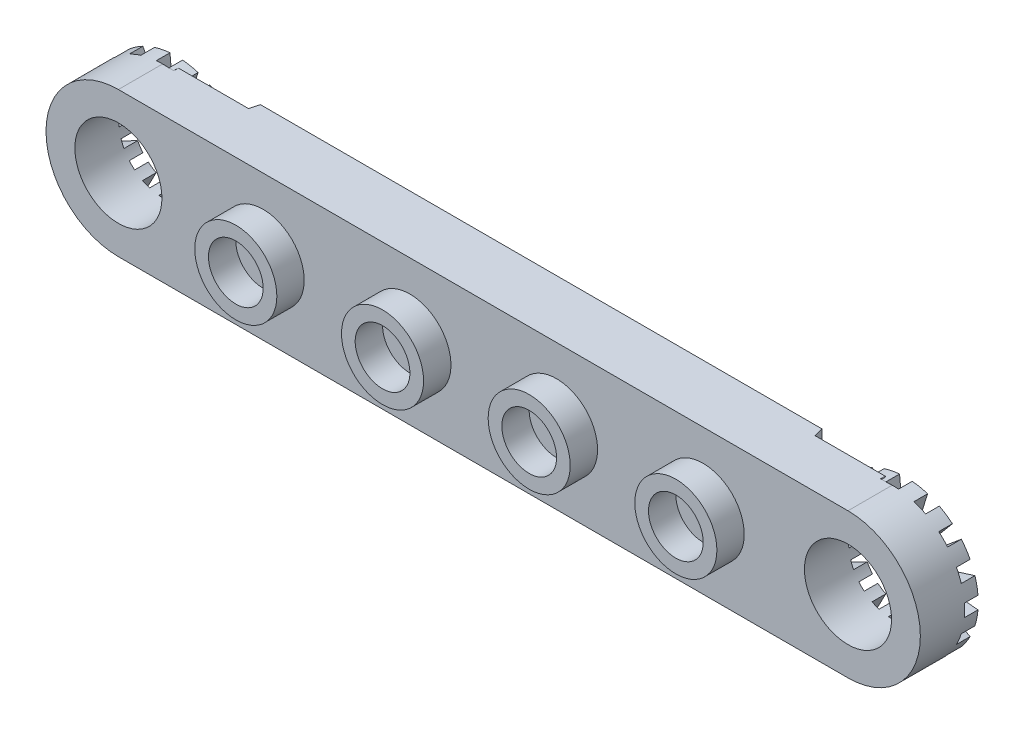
from build123d import *
from OCP.BRepFilletAPI import BRepFilletAPI_MakeChamfer

# Parameters (mm, degrees)
SKETCH1_R             = 2.3876
EXTRUDE1_DEPTH        = 1.2065
SKETCH2_R             = 2.25
SKETCH2_R_2           = 1.5
EXTRUDE_THIN1_DEPTH   = 1.5
SKETCH3_W             = 30.7924
SKETCH3_H             = 7.9375
EXTRUDE2_DEPTH        = 0.762
CHAMFER1_SIZE         = 0.2
CHAMFER1_SIZE2        = 0.76
CUT_EXTRUDE1_START    = -1.5
SKETCH4_W             = 5.5
SKETCH4_H             = 4.9375
CUT_EXTRUDE1_DEPTH    = 1.5
EXTRUDE3_DEPTH        = 0.25
SKETCH7_R             = 3.96875
SKETCH7_R_2           = 2.3876
EXTRUDE4_DEPTH        = 0.762
CUT_EXTRUDE3_START    = -0.75
CUT_EXTRUDE3_DEPTH    = 0.75
CIRPATTERN1_COUNT     = 16
MIRROR2_START         = -0.75
MIRROR2_COPY_1_DEPTH  = 0.75
MIRROR2_COPY_2_DEPTH  = 0.75
MIRROR2_COPY_3_DEPTH  = 0.75
MIRROR2_COPY_4_DEPTH  = 0.75
MIRROR2_COPY_5_DEPTH  = 0.75
MIRROR2_COPY_6_DEPTH  = 0.75
MIRROR2_COPY_7_DEPTH  = 0.75
MIRROR2_COPY_8_DEPTH  = 0.75
MIRROR2_COPY_9_DEPTH  = 0.75
MIRROR2_COPY_10_DEPTH = 0.75
MIRROR2_COPY_11_DEPTH = 0.75
MIRROR2_COPY_12_DEPTH = 0.75
MIRROR2_COPY_13_DEPTH = 0.75
MIRROR2_COPY_14_DEPTH = 0.75
MIRROR2_COPY_15_DEPTH = 0.75
SKETCH10_R            = 2.25
EXTRUDE5_DEPTH        = 1.5
SKETCH12_R            = 1.5
EXTRUDE6_DEPTH        = 1.5
SKETCH13_W            = 9.014979
SKETCH13_H            = 4.9375
EXTRUDE7_DEPTH        = 1.5


with BuildPart() as part:
    # Sketch1 → Extrude1 (new, symmetric)
    with BuildSketch(Plane.XY):
        with BuildLine():
            Line((20, 3.96875), (-20, 3.96875))
            ThreePointArc((-20, 3.96875), (-23.96875, 0), (-20, -3.96875))
            Line((-20, -3.96875), (20, -3.96875))
            ThreePointArc((20, -3.96875), (23.96875, 0), (20, 3.96875))
        make_face()
        with Locations((-20, 0)):
            Circle(SKETCH1_R, mode=Mode.SUBTRACT)
        with Locations((20, 0)):
            Circle(SKETCH1_R, mode=Mode.SUBTRACT)
    extrude(amount=EXTRUDE1_DEPTH, both=True)

    # Sketch2 → Extrude-Thin1 (add)
    # profile 1 of 2: a face of its own
    with BuildSketch(Plane.XY.offset(1.2065)):
        with Locations((-12.0625, 0)):
            Circle(SKETCH2_R)
        with Locations((-12.0625, 0)):
            Circle(SKETCH2_R_2, mode=Mode.SUBTRACT)
    # profile 2 of 2: a face of its own
    with BuildSketch(Plane.XY.offset(1.2065)):
        with Locations((12.0625, 0)):
            Circle(SKETCH2_R)
        with Locations((12.0625, 0)):
            Circle(SKETCH2_R_2, mode=Mode.SUBTRACT)
    extrude(amount=EXTRUDE_THIN1_DEPTH)

    # Sketch3 → Extrude2 (add)
    with BuildSketch(Plane(origin=(0, 0, -1.2065), x_dir=(-1, 0, 0), z_dir=(0, 0, -1))):
        Rectangle(SKETCH3_W, SKETCH3_H)
    extrude(amount=EXTRUDE2_DEPTH)

    # Chamfer1: one chamfer whose edges measure the first distance from different faces: ONE call of the kernel's chamfer builder (chamfer() names one face for all edges)
    chamfer1_edges_1 = [part.edges().sort_by_distance(p)[0] for p in [
        (15.3962, 0, -1.2065),
    ]]
    chamfer1_side_1 = [part.faces().sort_by_distance(p)[0] for p in [
        (23.85192, 0, -1.2065),
    ]]
    chamfer1_edges_2 = [part.edges().sort_by_distance(p)[0] for p in [
        (-15.3962, 0, -1.2065),
    ]]
    chamfer1_side_2 = [part.faces().sort_by_distance(p)[0] for p in [
        (-15.51303, 0, -1.2065),
    ]]
    chamfer1 = BRepFilletAPI_MakeChamfer(part.part.solid().wrapped)
    for e in chamfer1_edges_1:
        chamfer1.Add(CHAMFER1_SIZE, CHAMFER1_SIZE2, e.wrapped, chamfer1_side_1[0].wrapped)  # the first distance lies on this face
    for e in chamfer1_edges_2:
        chamfer1.Add(CHAMFER1_SIZE, CHAMFER1_SIZE2, e.wrapped, chamfer1_side_2[0].wrapped)  # the first distance lies on this face
    add(Compound.cast(chamfer1.Shape()), mode=Mode.REPLACE)

    # Sketch4 → Cut-Extrude1 (cut)
    with BuildSketch(Plane(origin=(0, 0, -1.9685), x_dir=(-1, 0, 0), z_dir=(0, 0, -1)).offset(CUT_EXTRUDE1_START)):
        with BuildLine():
            Line((15.5962, 2.46875), (16.892549, 2.46875))
            ThreePointArc((16.892549, 2.46875), (16.03125, 0), (16.892549, -2.46875))
            Line((16.892549, -2.46875), (15.5962, -2.46875))
            Line((15.5962, -2.46875), (15.5962, 2.46875))
        make_face()
        with Locations((12.1462, 0)):
            Rectangle(SKETCH4_W, SKETCH4_H)
        with BuildLine():
            Line((8.5462, 2.46875), (8.5462, -2.46875))
            Line((8.5462, -2.46875), (2.409932, -2.46875))
            ThreePointArc((2.409932, -2.46875), (3.45, 0), (2.409932, 2.46875))
            Line((2.409932, 2.46875), (8.5462, 2.46875))
        make_face()
    cut_extrude1 = extrude(amount=CUT_EXTRUDE1_DEPTH, mode=Mode.SUBTRACT)

    # Mirror1: Cut-Extrude1 across plane
    add(cut_extrude1.mirror(Plane(origin=(0, 0, 0), x_dir=(0, 0, 1), z_dir=(1, 0, 0))), mode=Mode.SUBTRACT)

    # Sketch6 → Extrude3 (add)
    with BuildSketch(Plane(origin=(0, 0, -1.2065), x_dir=(-1, 0, 0), z_dir=(0, 0, -1))):
        with BuildLine():
            Line((-19.37002, 3.96875), (-15.3962, 3.96875))
            Line((-15.3962, 3.96875), (-15.3962, 2.46875))
            Line((-15.3962, 2.46875), (-16.892549, 2.46875))
            ThreePointArc((-16.892549, 2.46875), (-17.997356, 3.426426), (-19.373963, 3.919063))
            ThreePointArc((-19.373963, 3.919063), (-19.394941, 3.945728), (-19.37002, 3.96875))
        make_face()
        with BuildLine():
            Line((-16.892549, -2.46875), (-15.3962, -2.46875))
            Line((-15.3962, -2.46875), (-15.3962, -3.96875))
            Line((-15.3962, -3.96875), (-19.37002, -3.96875))
            ThreePointArc((-19.37002, -3.96875), (-19.394941, -3.945728), (-19.373963, -3.919063))
            ThreePointArc((-19.373963, -3.919063), (-17.997356, -3.426426), (-16.892549, -2.46875))
        make_face()
    extrude3 = extrude(amount=EXTRUDE3_DEPTH)

    # Sketch7 → Extrude4 (add)
    with BuildSketch(Plane(origin=(0, 0, -1.2065), x_dir=(-1, 0, 0), z_dir=(0, 0, -1))):
        with Locations((-20, 0)):
            Circle(SKETCH7_R)
        with Locations((-20, 0)):
            Circle(SKETCH7_R_2, mode=Mode.SUBTRACT)
    extrude4 = extrude(amount=EXTRUDE4_DEPTH)

    # Sketch8 → Cut-Extrude3 (cut)
    with BuildSketch(Plane(origin=(0, 0, -1.9685), x_dir=(-1, 0, 0), z_dir=(0, 0, -1)).offset(CUT_EXTRUDE3_START)):
        with BuildLine():
            Line((-20.208093, 2.378514), (-20.345899, 3.953648))
            ThreePointArc((-20.345899, 3.953648), (-20, 3.96875), (-19.654101, 3.953648))
            Line((-19.654101, 3.953648), (-19.791907, 2.378514))
            ThreePointArc((-19.791907, 2.378514), (-20, 2.3876), (-20.208093, 2.378514))
        make_face()
    cut_extrude3 = extrude(amount=CUT_EXTRUDE3_DEPTH, mode=Mode.SUBTRACT)

    # CirPattern1: Cut-Extrude3 ×16 about axis
    cirpattern1_axis = Axis((20, 0, 0), (0, 0, 1))
    for i in range(1, CIRPATTERN1_COUNT):
        add(cut_extrude3.rotate(cirpattern1_axis, i * 360 / CIRPATTERN1_COUNT), mode=Mode.SUBTRACT)

    # Mirror2: Extrude3, Extrude4, Cut-Extrude3 across plane
    add(extrude3.mirror(Plane(origin=(0, 0, 0), x_dir=(0, 0, 1), z_dir=(1, 0, 0))))
    add(extrude4.mirror(Plane(origin=(0, 0, 0), x_dir=(0, 0, 1), z_dir=(1, 0, 0))))
    add(cut_extrude3.mirror(Plane(origin=(0, 0, 0), x_dir=(0, 0, 1), z_dir=(1, 0, 0))), mode=Mode.SUBTRACT)

    # Mirror2 copy 1 sketch → Mirror2 copy 1 (cut)
    with BuildSketch(Plane(origin=(-1.522409, -7.653669, -1.9685), x_dir=(0.9238795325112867, -0.3826834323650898, 0), z_dir=(0, 0, -1)).offset(MIRROR2_START)):
        with BuildLine():
            Line((-20.208093, -2.378514), (-20.345899, -3.953648))
            ThreePointArc((-20.345899, -3.953648), (-20, -3.96875), (-19.654101, -3.953648))
            Line((-19.654101, -3.953648), (-19.791907, -2.378514))
            ThreePointArc((-19.791907, -2.378514), (-20, -2.3876), (-20.208093, -2.378514))
        make_face()
    extrude(amount=MIRROR2_COPY_1_DEPTH, mode=Mode.SUBTRACT)

    # Mirror2 copy 2 sketch → Mirror2 copy 2 (cut)
    with BuildSketch(Plane(origin=(-5.857864, -14.142136, -1.9685), x_dir=(0.7071067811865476, -0.7071067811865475, 0), z_dir=(0, 0, -1)).offset(MIRROR2_START)):
        with BuildLine():
            Line((-20.208093, -2.378514), (-20.345899, -3.953648))
            ThreePointArc((-20.345899, -3.953648), (-20, -3.96875), (-19.654101, -3.953648))
            Line((-19.654101, -3.953648), (-19.791907, -2.378514))
            ThreePointArc((-19.791907, -2.378514), (-20, -2.3876), (-20.208093, -2.378514))
        make_face()
    extrude(amount=MIRROR2_COPY_2_DEPTH, mode=Mode.SUBTRACT)

    # Mirror2 copy 3 sketch → Mirror2 copy 3 (cut)
    with BuildSketch(Plane(origin=(-12.346331, -18.477591, -1.9685), x_dir=(0.38268343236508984, -0.9238795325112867, 0), z_dir=(0, 0, -1)).offset(MIRROR2_START)):
        with BuildLine():
            Line((-20.208093, -2.378514), (-20.345899, -3.953648))
            ThreePointArc((-20.345899, -3.953648), (-20, -3.96875), (-19.654101, -3.953648))
            Line((-19.654101, -3.953648), (-19.791907, -2.378514))
            ThreePointArc((-19.791907, -2.378514), (-20, -2.3876), (-20.208093, -2.378514))
        make_face()
    extrude(amount=MIRROR2_COPY_3_DEPTH, mode=Mode.SUBTRACT)

    # Mirror2 copy 4 sketch → Mirror2 copy 4 (cut)
    with BuildSketch(Plane(origin=(-20, -20, -1.9685), x_dir=(0, -1, 0), z_dir=(0, 0, -1)).offset(MIRROR2_START)):
        with BuildLine():
            Line((-20.208093, -2.378514), (-20.345899, -3.953648))
            ThreePointArc((-20.345899, -3.953648), (-20, -3.96875), (-19.654101, -3.953648))
            Line((-19.654101, -3.953648), (-19.791907, -2.378514))
            ThreePointArc((-19.791907, -2.378514), (-20, -2.3876), (-20.208093, -2.378514))
        make_face()
    extrude(amount=MIRROR2_COPY_4_DEPTH, mode=Mode.SUBTRACT)

    # Mirror2 copy 5 sketch → Mirror2 copy 5 (cut)
    with BuildSketch(Plane(origin=(-27.653669, -18.477591, -1.9685), x_dir=(-0.3826834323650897, -0.9238795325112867, 0), z_dir=(0, 0, -1)).offset(MIRROR2_START)):
        with BuildLine():
            Line((-20.208093, -2.378514), (-20.345899, -3.953648))
            ThreePointArc((-20.345899, -3.953648), (-20, -3.96875), (-19.654101, -3.953648))
            Line((-19.654101, -3.953648), (-19.791907, -2.378514))
            ThreePointArc((-19.791907, -2.378514), (-20, -2.3876), (-20.208093, -2.378514))
        make_face()
    extrude(amount=MIRROR2_COPY_5_DEPTH, mode=Mode.SUBTRACT)

    # Mirror2 copy 6 sketch → Mirror2 copy 6 (cut)
    with BuildSketch(Plane(origin=(-34.142136, -14.142136, -1.9685), x_dir=(-0.7071067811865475, -0.7071067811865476, 0), z_dir=(0, 0, -1)).offset(MIRROR2_START)):
        with BuildLine():
            Line((-20.208093, -2.378514), (-20.345899, -3.953648))
            ThreePointArc((-20.345899, -3.953648), (-20, -3.96875), (-19.654101, -3.953648))
            Line((-19.654101, -3.953648), (-19.791907, -2.378514))
            ThreePointArc((-19.791907, -2.378514), (-20, -2.3876), (-20.208093, -2.378514))
        make_face()
    extrude(amount=MIRROR2_COPY_6_DEPTH, mode=Mode.SUBTRACT)

    # Mirror2 copy 7 sketch → Mirror2 copy 7 (cut)
    with BuildSketch(Plane(origin=(-38.477591, -7.653669, -1.9685), x_dir=(-0.9238795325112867, -0.3826834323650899, 0), z_dir=(0, 0, -1)).offset(MIRROR2_START)):
        with BuildLine():
            Line((-20.208093, -2.378514), (-20.345899, -3.953648))
            ThreePointArc((-20.345899, -3.953648), (-20, -3.96875), (-19.654101, -3.953648))
            Line((-19.654101, -3.953648), (-19.791907, -2.378514))
            ThreePointArc((-19.791907, -2.378514), (-20, -2.3876), (-20.208093, -2.378514))
        make_face()
    extrude(amount=MIRROR2_COPY_7_DEPTH, mode=Mode.SUBTRACT)

    # Mirror2 copy 8 sketch → Mirror2 copy 8 (cut)
    with BuildSketch(Plane(origin=(-40, 0, -1.9685), x_dir=(-1, 0, 0), z_dir=(0, 0, -1)).offset(MIRROR2_START)):
        with BuildLine():
            Line((-20.208093, -2.378514), (-20.345899, -3.953648))
            ThreePointArc((-20.345899, -3.953648), (-20, -3.96875), (-19.654101, -3.953648))
            Line((-19.654101, -3.953648), (-19.791907, -2.378514))
            ThreePointArc((-19.791907, -2.378514), (-20, -2.3876), (-20.208093, -2.378514))
        make_face()
    extrude(amount=MIRROR2_COPY_8_DEPTH, mode=Mode.SUBTRACT)

    # Mirror2 copy 9 sketch → Mirror2 copy 9 (cut)
    with BuildSketch(Plane(origin=(-38.477591, 7.653669, -1.9685), x_dir=(-0.9238795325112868, 0.38268343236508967, 0), z_dir=(0, 0, -1)).offset(MIRROR2_START)):
        with BuildLine():
            Line((-20.208093, -2.378514), (-20.345899, -3.953648))
            ThreePointArc((-20.345899, -3.953648), (-20, -3.96875), (-19.654101, -3.953648))
            Line((-19.654101, -3.953648), (-19.791907, -2.378514))
            ThreePointArc((-19.791907, -2.378514), (-20, -2.3876), (-20.208093, -2.378514))
        make_face()
    extrude(amount=MIRROR2_COPY_9_DEPTH, mode=Mode.SUBTRACT)

    # Mirror2 copy 10 sketch → Mirror2 copy 10 (cut)
    with BuildSketch(Plane(origin=(-34.142136, 14.142136, -1.9685), x_dir=(-0.7071067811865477, 0.7071067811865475, 0), z_dir=(0, 0, -1)).offset(MIRROR2_START)):
        with BuildLine():
            Line((-20.208093, -2.378514), (-20.345899, -3.953648))
            ThreePointArc((-20.345899, -3.953648), (-20, -3.96875), (-19.654101, -3.953648))
            Line((-19.654101, -3.953648), (-19.791907, -2.378514))
            ThreePointArc((-19.791907, -2.378514), (-20, -2.3876), (-20.208093, -2.378514))
        make_face()
    extrude(amount=MIRROR2_COPY_10_DEPTH, mode=Mode.SUBTRACT)

    # Mirror2 copy 11 sketch → Mirror2 copy 11 (cut)
    with BuildSketch(Plane(origin=(-27.653669, 18.477591, -1.9685), x_dir=(-0.3826834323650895, 0.9238795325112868, 0), z_dir=(0, 0, -1)).offset(MIRROR2_START)):
        with BuildLine():
            Line((-20.208093, -2.378514), (-20.345899, -3.953648))
            ThreePointArc((-20.345899, -3.953648), (-20, -3.96875), (-19.654101, -3.953648))
            Line((-19.654101, -3.953648), (-19.791907, -2.378514))
            ThreePointArc((-19.791907, -2.378514), (-20, -2.3876), (-20.208093, -2.378514))
        make_face()
    extrude(amount=MIRROR2_COPY_11_DEPTH, mode=Mode.SUBTRACT)

    # Mirror2 copy 12 sketch → Mirror2 copy 12 (cut)
    with BuildSketch(Plane(origin=(-20, 20, -1.9685), x_dir=(0, 1, 0), z_dir=(0, 0, -1)).offset(MIRROR2_START)):
        with BuildLine():
            Line((-20.208093, -2.378514), (-20.345899, -3.953648))
            ThreePointArc((-20.345899, -3.953648), (-20, -3.96875), (-19.654101, -3.953648))
            Line((-19.654101, -3.953648), (-19.791907, -2.378514))
            ThreePointArc((-19.791907, -2.378514), (-20, -2.3876), (-20.208093, -2.378514))
        make_face()
    extrude(amount=MIRROR2_COPY_12_DEPTH, mode=Mode.SUBTRACT)

    # Mirror2 copy 13 sketch → Mirror2 copy 13 (cut)
    with BuildSketch(Plane(origin=(-12.346331, 18.477591, -1.9685), x_dir=(0.38268343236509, 0.9238795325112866, 0), z_dir=(0, 0, -1)).offset(MIRROR2_START)):
        with BuildLine():
            Line((-20.208093, -2.378514), (-20.345899, -3.953648))
            ThreePointArc((-20.345899, -3.953648), (-20, -3.96875), (-19.654101, -3.953648))
            Line((-19.654101, -3.953648), (-19.791907, -2.378514))
            ThreePointArc((-19.791907, -2.378514), (-20, -2.3876), (-20.208093, -2.378514))
        make_face()
    extrude(amount=MIRROR2_COPY_13_DEPTH, mode=Mode.SUBTRACT)

    # Mirror2 copy 14 sketch → Mirror2 copy 14 (cut)
    with BuildSketch(Plane(origin=(-5.857864, 14.142136, -1.9685), x_dir=(0.7071067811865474, 0.7071067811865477, 0), z_dir=(0, 0, -1)).offset(MIRROR2_START)):
        with BuildLine():
            Line((-20.208093, -2.378514), (-20.345899, -3.953648))
            ThreePointArc((-20.345899, -3.953648), (-20, -3.96875), (-19.654101, -3.953648))
            Line((-19.654101, -3.953648), (-19.791907, -2.378514))
            ThreePointArc((-19.791907, -2.378514), (-20, -2.3876), (-20.208093, -2.378514))
        make_face()
    extrude(amount=MIRROR2_COPY_14_DEPTH, mode=Mode.SUBTRACT)

    # Mirror2 copy 15 sketch → Mirror2 copy 15 (cut)
    with BuildSketch(Plane(origin=(-1.522409, 7.653669, -1.9685), x_dir=(0.9238795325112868, 0.38268343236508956, 0), z_dir=(0, 0, -1)).offset(MIRROR2_START)):
        with BuildLine():
            Line((-20.208093, -2.378514), (-20.345899, -3.953648))
            ThreePointArc((-20.345899, -3.953648), (-20, -3.96875), (-19.654101, -3.953648))
            Line((-19.654101, -3.953648), (-19.791907, -2.378514))
            ThreePointArc((-19.791907, -2.378514), (-20, -2.3876), (-20.208093, -2.378514))
        make_face()
    extrude(amount=MIRROR2_COPY_15_DEPTH, mode=Mode.SUBTRACT)

    # Sketch10 → Extrude5 (add)
    with BuildSketch(Plane.XY.offset(1.2065)):
        with Locations(Location((-4.0175, 0, 0), (0, 0, 180))):
            Circle(SKETCH10_R)
        with Locations(Location((4.0225, 0, 0), (0, 0, 180))):
            Circle(SKETCH10_R)
    extrude(amount=EXTRUDE5_DEPTH)

    # Sketch12 → Extrude6 (cut)
    with BuildSketch(Plane.XY.offset(2.7065)):
        with Locations((-4.0175, 0)):
            Circle(SKETCH12_R)
        with Locations((4.0225, 0)):
            Circle(SKETCH12_R)
    extrude(amount=-EXTRUDE6_DEPTH, mode=Mode.SUBTRACT)

    # Sketch13 → Extrude7 (cut)
    with BuildSketch(Plane(origin=(0, 0, -1.9685), x_dir=(-1, 0, 0), z_dir=(0, 0, -1))):
        with Locations((-0.325384, 0)):
            Rectangle(SKETCH13_W, SKETCH13_H)
    extrude(amount=-EXTRUDE7_DEPTH, mode=Mode.SUBTRACT)


solid = part.part
